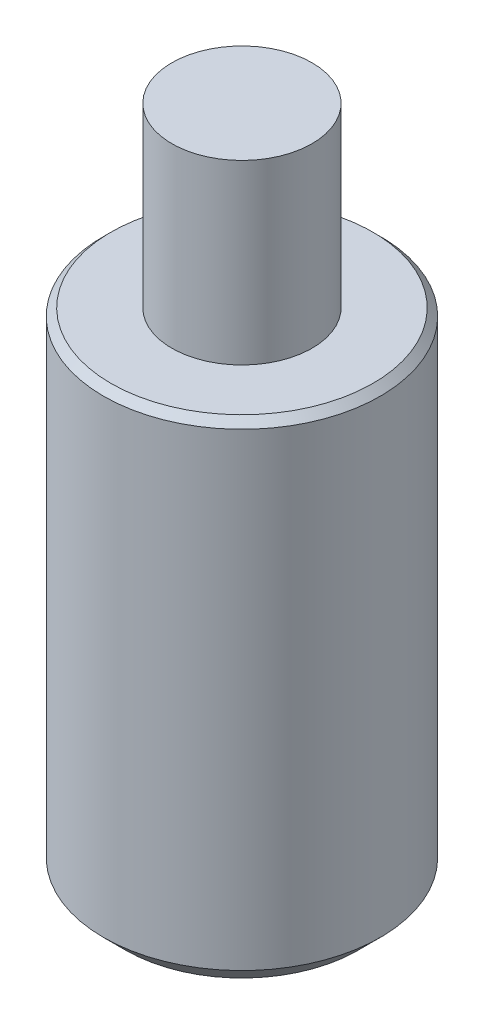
ISO-10303-21;
HEADER;
FILE_DESCRIPTION(('STEP AP214'),'2;1');
FILE_NAME('part.step','',(''),(''),'','','');
FILE_SCHEMA(('AUTOMOTIVE_DESIGN { 1 0 10303 214 1 1 1 1 }'));
ENDSEC;
DATA;
#1=APPLICATION_CONTEXT('core data for automotive mechanical design processes');
#2=APPLICATION_PROTOCOL_DEFINITION('international standard','automotive_design',2000,#1);
#3=PRODUCT_CONTEXT('',#1,'mechanical');
#4=PRODUCT('Part','Part','',(#3));
#5=PRODUCT_RELATED_PRODUCT_CATEGORY('part','',(#4));
#6=PRODUCT_DEFINITION_FORMATION('','',#4);
#7=PRODUCT_DEFINITION_CONTEXT('part definition',#1,'design');
#8=PRODUCT_DEFINITION('design','',#6,#7);
#9=PRODUCT_DEFINITION_SHAPE('','',#8);
#10=(LENGTH_UNIT() NAMED_UNIT(*) SI_UNIT(.MILLI.,.METRE.));
#11=(NAMED_UNIT(*) PLANE_ANGLE_UNIT() SI_UNIT($,.RADIAN.));
#12=(NAMED_UNIT(*) SI_UNIT($,.STERADIAN.) SOLID_ANGLE_UNIT());
#13=UNCERTAINTY_MEASURE_WITH_UNIT(LENGTH_MEASURE(1.E-05),#10,'distance_accuracy_value','');
#14=(GEOMETRIC_REPRESENTATION_CONTEXT(3) GLOBAL_UNCERTAINTY_ASSIGNED_CONTEXT((#13)) GLOBAL_UNIT_ASSIGNED_CONTEXT((#10,
#11,#12)) REPRESENTATION_CONTEXT('',''));
#15=CARTESIAN_POINT('',(0.,0.,0.));
#16=DIRECTION('',(0.,0.,1.));
#17=DIRECTION('',(1.,0.,0.));
#18=AXIS2_PLACEMENT_3D('',#15,#16,#17);
#19=CARTESIAN_POINT('',(0.,17.145,0.));
#20=DIRECTION('',(0.,1.,0.));
#21=DIRECTION('',(0.,0.,1.));
#22=AXIS2_PLACEMENT_3D('',#19,#20,#21);
#23=PLANE('',#22);
#24=CARTESIAN_POINT('',(0.,17.145,0.));
#25=DIRECTION('',(0.,1.,0.));
#26=DIRECTION('',(0.,0.,1.));
#27=AXIS2_PLACEMENT_3D('',#24,#25,#26);
#28=CIRCLE('',#27,4.5085);
#29=CARTESIAN_POINT('',(0.,17.145,4.5085));
#30=VERTEX_POINT('',#29);
#31=EDGE_CURVE('E147',#30,#30,#28,.T.);
#32=ORIENTED_EDGE('',*,*,#31,.T.);
#33=EDGE_LOOP('',(#32));
#34=FACE_BOUND('',#33,.T.);
#35=CARTESIAN_POINT('',(0.,17.145,0.));
#36=DIRECTION('',(0.,1.,0.));
#37=DIRECTION('',(0.,0.,1.));
#38=AXIS2_PLACEMENT_3D('',#35,#36,#37);
#39=CIRCLE('',#38,2.413);
#40=CARTESIAN_POINT('',(0.,17.145,-2.413));
#41=VERTEX_POINT('',#40);
#42=EDGE_CURVE('E138',#41,#41,#39,.T.);
#43=ORIENTED_EDGE('',*,*,#42,.F.);
#44=EDGE_LOOP('',(#43));
#45=FACE_BOUND('',#44,.T.);
#46=ADVANCED_FACE('F36',(#34,#45),#23,.T.);
#47=CARTESIAN_POINT('',(0.,17.145,0.));
#48=DIRECTION('',(0.,-1.,0.));
#49=DIRECTION('',(0.,0.,-1.));
#50=AXIS2_PLACEMENT_3D('',#47,#48,#49);
#51=CYLINDRICAL_SURFACE('',#50,4.7625);
#52=CARTESIAN_POINT('',(0.,0.762000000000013,0.));
#53=DIRECTION('',(0.,1.,0.));
#54=DIRECTION('',(0.,0.,1.));
#55=AXIS2_PLACEMENT_3D('',#52,#53,#54);
#56=CIRCLE('',#55,4.7625);
#57=CARTESIAN_POINT('',(0.,0.762000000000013,4.7625));
#58=VERTEX_POINT('',#57);
#59=EDGE_CURVE('E44',#58,#58,#56,.T.);
#60=ORIENTED_EDGE('',*,*,#59,.T.);
#61=EDGE_LOOP('',(#60));
#62=FACE_BOUND('',#61,.T.);
#63=CARTESIAN_POINT('',(0.,16.891,0.));
#64=DIRECTION('',(0.,1.,0.));
#65=DIRECTION('',(0.,0.,1.));
#66=AXIS2_PLACEMENT_3D('',#63,#64,#65);
#67=CIRCLE('',#66,4.7625);
#68=CARTESIAN_POINT('',(0.,16.891,4.7625));
#69=VERTEX_POINT('',#68);
#70=EDGE_CURVE('E152',#69,#69,#67,.F.);
#71=ORIENTED_EDGE('',*,*,#70,.T.);
#72=EDGE_LOOP('',(#71));
#73=FACE_BOUND('',#72,.T.);
#74=ADVANCED_FACE('F157',(#62,#73),#51,.T.);
#75=CARTESIAN_POINT('',(0.,0.,0.));
#76=DIRECTION('',(0.,1.,0.));
#77=DIRECTION('',(0.,0.,1.));
#78=AXIS2_PLACEMENT_3D('',#75,#76,#77);
#79=PLANE('',#78);
#80=CARTESIAN_POINT('',(0.,0.,0.));
#81=DIRECTION('',(0.,1.,0.));
#82=DIRECTION('',(0.,0.,1.));
#83=AXIS2_PLACEMENT_3D('',#80,#81,#82);
#84=CIRCLE('',#83,4.00049999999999);
#85=CARTESIAN_POINT('',(0.,0.,4.00049999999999));
#86=VERTEX_POINT('',#85);
#87=EDGE_CURVE('E11',#86,#86,#84,.F.);
#88=ORIENTED_EDGE('',*,*,#87,.T.);
#89=EDGE_LOOP('',(#88));
#90=FACE_BOUND('',#89,.T.);
#91=DIRECTION('',(-1.,0.,0.));
#92=VECTOR('',#91,1.);
#93=CARTESIAN_POINT('',(1.37848150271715,0.,2.3876));
#94=LINE('',#93,#92);
#95=CARTESIAN_POINT('',(1.37848150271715,0.,2.3876));
#96=VERTEX_POINT('',#95);
#97=CARTESIAN_POINT('',(-1.37848150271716,0.,2.3876));
#98=VERTEX_POINT('',#97);
#99=EDGE_CURVE('E125',#96,#98,#94,.T.);
#100=ORIENTED_EDGE('',*,*,#99,.F.);
#101=DIRECTION('',(-0.5,0.,0.866025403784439));
#102=VECTOR('',#101,1.);
#103=CARTESIAN_POINT('',(2.75696300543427,0.,0.));
#104=LINE('',#103,#102);
#105=CARTESIAN_POINT('',(2.75696300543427,0.,0.));
#106=VERTEX_POINT('',#105);
#107=EDGE_CURVE('E51',#106,#96,#104,.T.);
#108=ORIENTED_EDGE('',*,*,#107,.F.);
#109=DIRECTION('',(0.500000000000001,0.,0.86602540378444));
#110=VECTOR('',#109,1.);
#111=CARTESIAN_POINT('',(1.37848150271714,0.,-2.3876));
#112=LINE('',#111,#110);
#113=CARTESIAN_POINT('',(1.37848150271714,0.,-2.3876));
#114=VERTEX_POINT('',#113);
#115=EDGE_CURVE('E134',#114,#106,#112,.T.);
#116=ORIENTED_EDGE('',*,*,#115,.F.);
#117=DIRECTION('',(1.,0.,0.));
#118=VECTOR('',#117,1.);
#119=CARTESIAN_POINT('',(-1.37848150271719,0.,-2.38759999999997));
#120=LINE('',#119,#118);
#121=CARTESIAN_POINT('',(-1.37848150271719,0.,-2.38759999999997));
#122=VERTEX_POINT('',#121);
#123=EDGE_CURVE('E132',#122,#114,#120,.T.);
#124=ORIENTED_EDGE('',*,*,#123,.F.);
#125=DIRECTION('',(0.5,0.,-0.866025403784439));
#126=VECTOR('',#125,1.);
#127=CARTESIAN_POINT('',(-2.75696300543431,0.,0.));
#128=LINE('',#127,#126);
#129=CARTESIAN_POINT('',(-2.75696300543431,0.,0.));
#130=VERTEX_POINT('',#129);
#131=EDGE_CURVE('E99',#130,#122,#128,.T.);
#132=ORIENTED_EDGE('',*,*,#131,.F.);
#133=DIRECTION('',(-0.500000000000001,0.,-0.86602540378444));
#134=VECTOR('',#133,1.);
#135=CARTESIAN_POINT('',(-1.37848150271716,0.,2.3876));
#136=LINE('',#135,#134);
#137=EDGE_CURVE('E128',#98,#130,#136,.T.);
#138=ORIENTED_EDGE('',*,*,#137,.F.);
#139=EDGE_LOOP('',(#100,#108,#116,#124,#132,#138));
#140=FACE_BOUND('',#139,.T.);
#141=ADVANCED_FACE('F174',(#90,#140),#79,.F.);
#142=CARTESIAN_POINT('',(0.,23.241,0.));
#143=DIRECTION('',(0.,-1.,0.));
#144=DIRECTION('',(0.,0.,-1.));
#145=AXIS2_PLACEMENT_3D('',#142,#143,#144);
#146=CYLINDRICAL_SURFACE('',#145,2.413);
#147=CARTESIAN_POINT('',(0.,23.241,0.));
#148=DIRECTION('',(0.,1.,0.));
#149=DIRECTION('',(0.,0.,1.));
#150=AXIS2_PLACEMENT_3D('',#147,#148,#149);
#151=CIRCLE('',#150,2.413);
#152=CARTESIAN_POINT('',(0.,23.241,-2.413));
#153=VERTEX_POINT('',#152);
#154=EDGE_CURVE('E144',#153,#153,#151,.T.);
#155=CARTESIAN_POINT('',(0.,23.241,-2.413));
#156=CARTESIAN_POINT('',(0.,23.1775,-2.413));
#157=CARTESIAN_POINT('',(0.,23.114,-2.413));
#158=CARTESIAN_POINT('',(0.,22.987,-2.413));
#159=CARTESIAN_POINT('',(0.,22.9235,-2.413));
#160=CARTESIAN_POINT('',(0.,22.7965,-2.413));
#161=CARTESIAN_POINT('',(0.,22.733,-2.413));
#162=CARTESIAN_POINT('',(0.,22.606,-2.413));
#163=CARTESIAN_POINT('',(0.,22.5425,-2.413));
#164=CARTESIAN_POINT('',(0.,22.4155,-2.413));
#165=CARTESIAN_POINT('',(0.,22.352,-2.413));
#166=CARTESIAN_POINT('',(0.,22.225,-2.413));
#167=CARTESIAN_POINT('',(0.,22.1615,-2.413));
#168=CARTESIAN_POINT('',(0.,22.0345,-2.413));
#169=CARTESIAN_POINT('',(0.,21.971,-2.413));
#170=CARTESIAN_POINT('',(0.,21.844,-2.413));
#171=CARTESIAN_POINT('',(0.,21.7805,-2.413));
#172=CARTESIAN_POINT('',(0.,21.6535,-2.413));
#173=CARTESIAN_POINT('',(0.,21.59,-2.413));
#174=CARTESIAN_POINT('',(0.,21.463,-2.413));
#175=CARTESIAN_POINT('',(0.,21.3995,-2.413));
#176=CARTESIAN_POINT('',(0.,21.2725,-2.413));
#177=CARTESIAN_POINT('',(0.,21.209,-2.413));
#178=CARTESIAN_POINT('',(0.,21.082,-2.413));
#179=CARTESIAN_POINT('',(0.,21.0185,-2.413));
#180=CARTESIAN_POINT('',(0.,20.8915,-2.413));
#181=CARTESIAN_POINT('',(0.,20.828,-2.413));
#182=CARTESIAN_POINT('',(0.,20.701,-2.413));
#183=CARTESIAN_POINT('',(0.,20.6375,-2.413));
#184=CARTESIAN_POINT('',(0.,20.5105,-2.413));
#185=CARTESIAN_POINT('',(0.,20.447,-2.413));
#186=CARTESIAN_POINT('',(0.,20.32,-2.413));
#187=CARTESIAN_POINT('',(0.,20.2565,-2.413));
#188=CARTESIAN_POINT('',(0.,20.1295,-2.413));
#189=CARTESIAN_POINT('',(0.,20.066,-2.413));
#190=CARTESIAN_POINT('',(0.,19.939,-2.413));
#191=CARTESIAN_POINT('',(0.,19.8755,-2.413));
#192=CARTESIAN_POINT('',(0.,19.7485,-2.413));
#193=CARTESIAN_POINT('',(0.,19.685,-2.413));
#194=CARTESIAN_POINT('',(0.,19.558,-2.413));
#195=CARTESIAN_POINT('',(0.,19.4945,-2.413));
#196=CARTESIAN_POINT('',(0.,19.3675,-2.413));
#197=CARTESIAN_POINT('',(0.,19.304,-2.413));
#198=CARTESIAN_POINT('',(0.,19.177,-2.413));
#199=CARTESIAN_POINT('',(0.,19.1135,-2.413));
#200=CARTESIAN_POINT('',(0.,18.9865,-2.413));
#201=CARTESIAN_POINT('',(0.,18.923,-2.413));
#202=CARTESIAN_POINT('',(0.,18.796,-2.413));
#203=CARTESIAN_POINT('',(0.,18.7325,-2.413));
#204=CARTESIAN_POINT('',(0.,18.6055,-2.413));
#205=CARTESIAN_POINT('',(0.,18.542,-2.413));
#206=CARTESIAN_POINT('',(0.,18.415,-2.413));
#207=CARTESIAN_POINT('',(0.,18.3515,-2.413));
#208=CARTESIAN_POINT('',(0.,18.2245,-2.413));
#209=CARTESIAN_POINT('',(0.,18.161,-2.413));
#210=CARTESIAN_POINT('',(0.,18.034,-2.413));
#211=CARTESIAN_POINT('',(0.,17.9705,-2.413));
#212=CARTESIAN_POINT('',(0.,17.8435,-2.413));
#213=CARTESIAN_POINT('',(0.,17.78,-2.413));
#214=CARTESIAN_POINT('',(0.,17.653,-2.413));
#215=CARTESIAN_POINT('',(0.,17.5895,-2.413));
#216=CARTESIAN_POINT('',(0.,17.4625,-2.413));
#217=CARTESIAN_POINT('',(0.,17.399,-2.413));
#218=CARTESIAN_POINT('',(0.,17.272,-2.413));
#219=CARTESIAN_POINT('',(0.,17.2085,-2.413));
#220=CARTESIAN_POINT('',(0.,17.145,-2.413));
#221=B_SPLINE_CURVE_WITH_KNOTS('',3,(#155,#156,#157,#158,#159,#160,#161,#162,#163,#164,#165,
#166,#167,#168,#169,#170,#171,#172,#173,#174,#175,#176,#177,#178,#179,#180,#181,#182,#183,#184,
#185,#186,#187,#188,#189,#190,#191,#192,#193,#194,#195,#196,#197,#198,#199,#200,#201,#202,#203,
#204,#205,#206,#207,#208,#209,#210,#211,#212,#213,#214,#215,#216,#217,#218,#219,#220),
.UNSPECIFIED.,.F.,.F.,(4,2,2,2,2,2,2,2,2,2,2,2,2,2,2,2,2,2,2,2,2,2,2,2,2,2,2,2,2,2,2,2,4),(0.,
0.190500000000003,0.381000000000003,0.571500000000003,0.762000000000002,0.952500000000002,1.143,
1.3335,1.524,1.7145,1.905,2.0955,2.286,2.4765,2.667,2.85750000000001,3.04800000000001,
3.23850000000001,3.42900000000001,3.6195,3.81,4.0005,4.191,4.3815,4.57200000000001,
4.76250000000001,4.95300000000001,5.14350000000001,5.334,5.52450000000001,5.71500000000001,
5.90550000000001,6.09600000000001),.UNSPECIFIED.);
#222=EDGE_CURVE('BSEAM179',#153,#41,#221,.T.);
#223=ORIENTED_EDGE('',*,*,#154,.F.);
#224=ORIENTED_EDGE('',*,*,#42,.T.);
#225=ORIENTED_EDGE('',*,*,#222,.T.);
#226=ORIENTED_EDGE('',*,*,#222,.F.);
#227=EDGE_LOOP('',(#223,#225,#224,#226));
#228=FACE_BOUND('',#227,.T.);
#229=ADVANCED_FACE('F179',(#228),#146,.T.);
#230=CARTESIAN_POINT('',(0.,23.241,0.));
#231=DIRECTION('',(0.,1.,0.));
#232=DIRECTION('',(0.,0.,1.));
#233=AXIS2_PLACEMENT_3D('',#230,#231,#232);
#234=PLANE('',#233);
#235=ORIENTED_EDGE('',*,*,#154,.T.);
#236=EDGE_LOOP('',(#235));
#237=FACE_BOUND('',#236,.T.);
#238=ADVANCED_FACE('F186',(#237),#234,.T.);
#239=CARTESIAN_POINT('',(0.,17.145,0.));
#240=DIRECTION('',(0.,-1.,0.));
#241=DIRECTION('',(0.,0.,-1.));
#242=AXIS2_PLACEMENT_3D('',#239,#240,#241);
#243=CONICAL_SURFACE('',#242,4.5085,0.78539816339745);
#244=ORIENTED_EDGE('',*,*,#70,.F.);
#245=EDGE_LOOP('',(#244));
#246=FACE_BOUND('',#245,.T.);
#247=ORIENTED_EDGE('',*,*,#31,.F.);
#248=EDGE_LOOP('',(#247));
#249=FACE_BOUND('',#248,.T.);
#250=ADVANCED_FACE('F183',(#246,#249),#243,.T.);
#251=CARTESIAN_POINT('',(2.75696300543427,3.175,0.));
#252=DIRECTION('',(0.866025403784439,0.,0.5));
#253=DIRECTION('',(0.5,0.,-0.866025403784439));
#254=AXIS2_PLACEMENT_3D('',#251,#252,#253);
#255=PLANE('',#254);
#256=ORIENTED_EDGE('',*,*,#107,.T.);
#257=DIRECTION('',(0.,-1.,0.));
#258=VECTOR('',#257,1.);
#259=CARTESIAN_POINT('',(1.37848150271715,3.175,2.3876));
#260=LINE('',#259,#258);
#261=CARTESIAN_POINT('',(1.37848150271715,3.175,2.3876));
#262=VERTEX_POINT('',#261);
#263=EDGE_CURVE('E81',#262,#96,#260,.T.);
#264=ORIENTED_EDGE('',*,*,#263,.F.);
#265=DIRECTION('',(-0.5,0.,0.866025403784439));
#266=VECTOR('',#265,1.);
#267=CARTESIAN_POINT('',(2.75696300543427,3.175,0.));
#268=LINE('',#267,#266);
#269=CARTESIAN_POINT('',(2.75696300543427,3.175,0.));
#270=VERTEX_POINT('',#269);
#271=EDGE_CURVE('E136',#270,#262,#268,.T.);
#272=ORIENTED_EDGE('',*,*,#271,.F.);
#273=DIRECTION('',(0.,-1.,0.));
#274=VECTOR('',#273,1.);
#275=CARTESIAN_POINT('',(2.75696300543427,3.175,0.));
#276=LINE('',#275,#274);
#277=EDGE_CURVE('E59',#270,#106,#276,.T.);
#278=ORIENTED_EDGE('',*,*,#277,.T.);
#279=EDGE_LOOP('',(#256,#264,#272,#278));
#280=FACE_BOUND('',#279,.T.);
#281=ADVANCED_FACE('F185',(#280),#255,.F.);
#282=CARTESIAN_POINT('',(1.37848150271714,3.175,-2.3876));
#283=DIRECTION('',(0.86602540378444,0.,-0.500000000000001));
#284=DIRECTION('',(-0.500000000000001,0.,-0.86602540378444));
#285=AXIS2_PLACEMENT_3D('',#282,#283,#284);
#286=PLANE('',#285);
#287=ORIENTED_EDGE('',*,*,#115,.T.);
#288=ORIENTED_EDGE('',*,*,#277,.F.);
#289=DIRECTION('',(0.500000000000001,0.,0.86602540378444));
#290=VECTOR('',#289,1.);
#291=CARTESIAN_POINT('',(1.37848150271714,3.175,-2.3876));
#292=LINE('',#291,#290);
#293=CARTESIAN_POINT('',(1.37848150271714,3.175,-2.3876));
#294=VERTEX_POINT('',#293);
#295=EDGE_CURVE('E111',#294,#270,#292,.T.);
#296=ORIENTED_EDGE('',*,*,#295,.F.);
#297=DIRECTION('',(0.,-1.,0.));
#298=VECTOR('',#297,1.);
#299=CARTESIAN_POINT('',(1.37848150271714,3.175,-2.3876));
#300=LINE('',#299,#298);
#301=EDGE_CURVE('E103',#294,#114,#300,.T.);
#302=ORIENTED_EDGE('',*,*,#301,.T.);
#303=EDGE_LOOP('',(#287,#288,#296,#302));
#304=FACE_BOUND('',#303,.T.);
#305=ADVANCED_FACE('F192',(#304),#286,.F.);
#306=CARTESIAN_POINT('',(-1.37848150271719,3.175,-2.38759999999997));
#307=DIRECTION('',(0.,0.,-1.));
#308=DIRECTION('',(-1.,0.,0.));
#309=AXIS2_PLACEMENT_3D('',#306,#307,#308);
#310=PLANE('',#309);
#311=ORIENTED_EDGE('',*,*,#123,.T.);
#312=ORIENTED_EDGE('',*,*,#301,.F.);
#313=DIRECTION('',(1.,0.,0.));
#314=VECTOR('',#313,1.);
#315=CARTESIAN_POINT('',(-1.37848150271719,3.175,-2.38759999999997));
#316=LINE('',#315,#314);
#317=CARTESIAN_POINT('',(-1.37848150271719,3.175,-2.38759999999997));
#318=VERTEX_POINT('',#317);
#319=EDGE_CURVE('E107',#318,#294,#316,.T.);
#320=ORIENTED_EDGE('',*,*,#319,.F.);
#321=DIRECTION('',(0.,-1.,0.));
#322=VECTOR('',#321,1.);
#323=CARTESIAN_POINT('',(-1.37848150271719,3.175,-2.38759999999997));
#324=LINE('',#323,#322);
#325=EDGE_CURVE('E92',#318,#122,#324,.T.);
#326=ORIENTED_EDGE('',*,*,#325,.T.);
#327=EDGE_LOOP('',(#311,#312,#320,#326));
#328=FACE_BOUND('',#327,.T.);
#329=ADVANCED_FACE('F108',(#328),#310,.F.);
#330=CARTESIAN_POINT('',(-2.75696300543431,3.175,0.));
#331=DIRECTION('',(-0.866025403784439,0.,-0.5));
#332=DIRECTION('',(-0.5,0.,0.866025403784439));
#333=AXIS2_PLACEMENT_3D('',#330,#331,#332);
#334=PLANE('',#333);
#335=ORIENTED_EDGE('',*,*,#131,.T.);
#336=ORIENTED_EDGE('',*,*,#325,.F.);
#337=DIRECTION('',(0.5,0.,-0.866025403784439));
#338=VECTOR('',#337,1.);
#339=CARTESIAN_POINT('',(-2.75696300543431,3.175,0.));
#340=LINE('',#339,#338);
#341=CARTESIAN_POINT('',(-2.75696300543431,3.175,0.));
#342=VERTEX_POINT('',#341);
#343=EDGE_CURVE('E96',#342,#318,#340,.T.);
#344=ORIENTED_EDGE('',*,*,#343,.F.);
#345=DIRECTION('',(0.,-1.,0.));
#346=VECTOR('',#345,1.);
#347=CARTESIAN_POINT('',(-2.75696300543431,3.175,0.));
#348=LINE('',#347,#346);
#349=EDGE_CURVE('E104',#342,#130,#348,.T.);
#350=ORIENTED_EDGE('',*,*,#349,.T.);
#351=EDGE_LOOP('',(#335,#336,#344,#350));
#352=FACE_BOUND('',#351,.T.);
#353=ADVANCED_FACE('F94',(#352),#334,.F.);
#354=CARTESIAN_POINT('',(-1.37848150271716,3.175,2.3876));
#355=DIRECTION('',(-0.86602540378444,0.,0.500000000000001));
#356=DIRECTION('',(0.500000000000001,0.,0.86602540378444));
#357=AXIS2_PLACEMENT_3D('',#354,#355,#356);
#358=PLANE('',#357);
#359=ORIENTED_EDGE('',*,*,#137,.T.);
#360=ORIENTED_EDGE('',*,*,#349,.F.);
#361=DIRECTION('',(-0.500000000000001,0.,-0.86602540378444));
#362=VECTOR('',#361,1.);
#363=CARTESIAN_POINT('',(-1.37848150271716,3.175,2.3876));
#364=LINE('',#363,#362);
#365=CARTESIAN_POINT('',(-1.37848150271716,3.175,2.3876));
#366=VERTEX_POINT('',#365);
#367=EDGE_CURVE('E117',#366,#342,#364,.T.);
#368=ORIENTED_EDGE('',*,*,#367,.F.);
#369=DIRECTION('',(0.,-1.,0.));
#370=VECTOR('',#369,1.);
#371=CARTESIAN_POINT('',(-1.37848150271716,3.175,2.3876));
#372=LINE('',#371,#370);
#373=EDGE_CURVE('E141',#366,#98,#372,.T.);
#374=ORIENTED_EDGE('',*,*,#373,.T.);
#375=EDGE_LOOP('',(#359,#360,#368,#374));
#376=FACE_BOUND('',#375,.T.);
#377=ADVANCED_FACE('F205',(#376),#358,.F.);
#378=CARTESIAN_POINT('',(1.37848150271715,3.175,2.3876));
#379=DIRECTION('',(0.,0.,1.));
#380=DIRECTION('',(1.,0.,0.));
#381=AXIS2_PLACEMENT_3D('',#378,#379,#380);
#382=PLANE('',#381);
#383=ORIENTED_EDGE('',*,*,#99,.T.);
#384=ORIENTED_EDGE('',*,*,#373,.F.);
#385=DIRECTION('',(-1.,0.,0.));
#386=VECTOR('',#385,1.);
#387=CARTESIAN_POINT('',(1.37848150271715,3.175,2.3876));
#388=LINE('',#387,#386);
#389=EDGE_CURVE('E119',#262,#366,#388,.T.);
#390=ORIENTED_EDGE('',*,*,#389,.F.);
#391=ORIENTED_EDGE('',*,*,#263,.T.);
#392=EDGE_LOOP('',(#383,#384,#390,#391));
#393=FACE_BOUND('',#392,.T.);
#394=ADVANCED_FACE('F165',(#393),#382,.F.);
#395=CARTESIAN_POINT('',(1.37848150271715,3.175,2.3876));
#396=DIRECTION('',(0.,-1.,0.));
#397=DIRECTION('',(0.,0.,-1.));
#398=AXIS2_PLACEMENT_3D('',#395,#396,#397);
#399=PLANE('',#398);
#400=ORIENTED_EDGE('',*,*,#271,.T.);
#401=ORIENTED_EDGE('',*,*,#389,.T.);
#402=ORIENTED_EDGE('',*,*,#367,.T.);
#403=ORIENTED_EDGE('',*,*,#343,.T.);
#404=ORIENTED_EDGE('',*,*,#319,.T.);
#405=ORIENTED_EDGE('',*,*,#295,.T.);
#406=EDGE_LOOP('',(#400,#401,#402,#403,#404,#405));
#407=FACE_BOUND('',#406,.T.);
#408=ADVANCED_FACE('F114',(#407),#399,.T.);
#409=CARTESIAN_POINT('',(0.,0.762000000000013,0.));
#410=DIRECTION('',(0.,1.,0.));
#411=DIRECTION('',(0.,0.,1.));
#412=AXIS2_PLACEMENT_3D('',#409,#410,#411);
#413=CONICAL_SURFACE('',#412,4.7625,0.785398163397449);
#414=ORIENTED_EDGE('',*,*,#87,.F.);
#415=EDGE_LOOP('',(#414));
#416=FACE_BOUND('',#415,.T.);
#417=ORIENTED_EDGE('',*,*,#59,.F.);
#418=EDGE_LOOP('',(#417));
#419=FACE_BOUND('',#418,.T.);
#420=ADVANCED_FACE('F38',(#416,#419),#413,.T.);
#421=CLOSED_SHELL('',(#46,#74,#141,#229,#238,#250,#281,#305,#329,#353,#377,#394,#408,#420));
#422=MANIFOLD_SOLID_BREP('B2',#421);
#423=ADVANCED_BREP_SHAPE_REPRESENTATION('',(#18,#422),#14);
#424=SHAPE_DEFINITION_REPRESENTATION(#9,#423);
ENDSEC;
END-ISO-10303-21;
